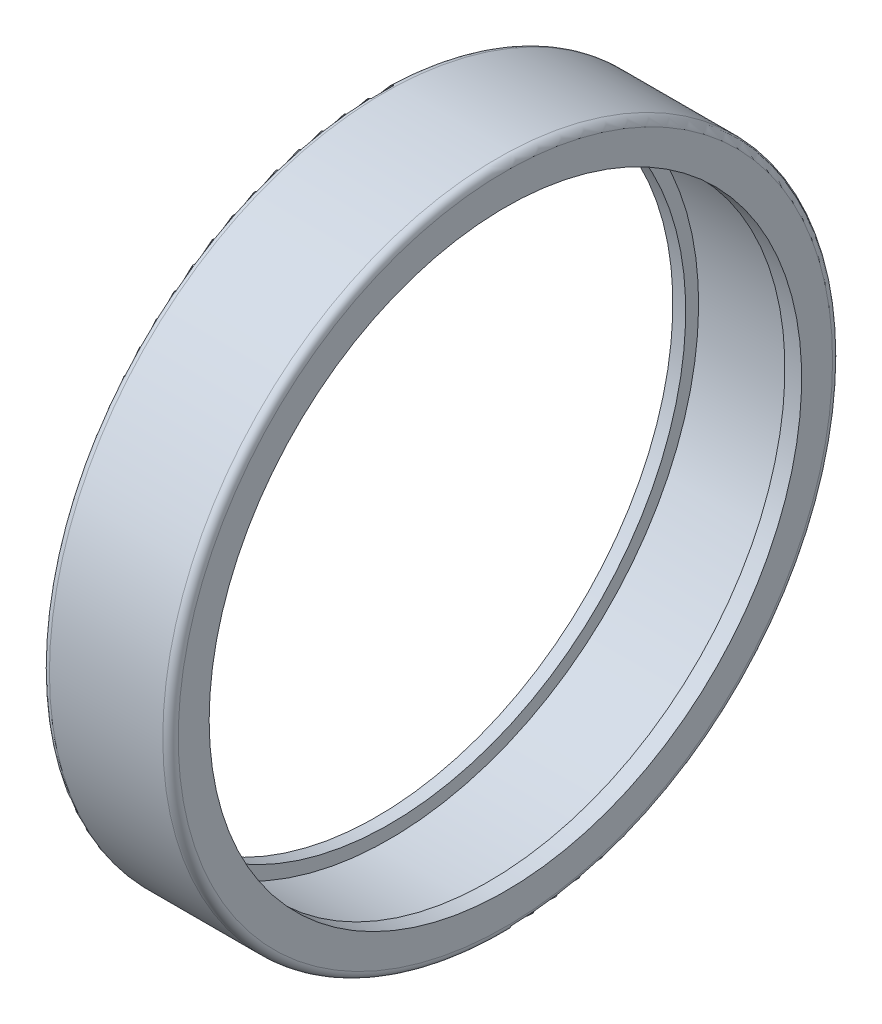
from build123d import *

# Parameters (mm, degrees)
CONG_1_R                = 0.3
ENL_V_MAT_EXTRU_1_DEPTH = 0.5


with BuildPart() as part:
    # Esquisse1 → Base-R_volution (revolve)
    with BuildSketch(Plane.XY, mode=Mode.PRIVATE) as base_r_volution_sk:
        Polygon((0, 13), (5, 13), (5, 11.5), (4.35, 11.5), (4.35, 12), (0.5, 12), (0.5, 11.5), (0, 11.5), align=None)
    revolve(base_r_volution_sk.sketch.rotate(Axis((-1.85, 0, 0), (1, 0, 0)), 90), axis=Axis((-1.85, 0, 0), (1, 0, 0)))

    # Cong_1
    cong_1_edges = [part.edges().sort_by_distance(p)[0] for p in [
        (0, 0, -13),
        (5, 0, -13),
    ]]
    fillet(cong_1_edges, radius=CONG_1_R)

    # Esquisse2 → Enl_v. mat.-Extru.1 (cut)
    with BuildSketch(Plane.ZY):
        with BuildLine():
            Line((-0.79725603, 12.439929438), (-0.899757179, 12.238840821))
            Line((-0.899757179, 12.238840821), (-0.917275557, 12.24890457))
            add(Edge.make_bspline(
                [(-0.917275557, 12.24890457), (-0.917139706, 12.250829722), (-0.916903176, 12.254181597), (-0.916772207, 12.257539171), (-0.91671646, 12.258968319)],
                knots=[0, 0, 0, 0, 1.148701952, 2, 2, 2, 2], degree=3))
            add(Edge.make_bspline(
                [(-0.91671646, 12.258968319), (-0.917194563, 12.262728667), (-0.918232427, 12.270891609), (-0.926282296, 12.282283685), (-0.937780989, 12.294121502), (-0.947748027, 12.301133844), (-0.953244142, 12.305000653)],
                knots=[0, 0, 0, 0, 0.73831218, 1.60272366, 2.678072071, 4, 4, 4, 4], degree=3))
            add(Edge.make_bspline(
                [(-0.953244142, 12.305000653), (-0.962648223, 12.311253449), (-0.98142957, 12.32374121), (-1.011430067, 12.339526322), (-1.042548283, 12.352899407), (-1.074822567, 12.364108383), (-1.108435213, 12.372288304), (-1.143202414, 12.378588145), (-1.179235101, 12.382064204), (-1.203650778, 12.382619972), (-1.216019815, 12.382901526)],
                knots=[0, 0, 0, 0, 0.972885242, 1.942996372, 2.916765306, 3.890416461, 4.883889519, 5.895380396, 6.933794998, 8, 8, 8, 8], degree=3))
            add(Edge.make_bspline(
                [(-1.216019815, 12.382901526), (-1.226281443, 12.382774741), (-1.246236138, 12.382528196), (-1.275168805, 12.379124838), (-1.302402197, 12.374447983), (-1.319498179, 12.369107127), (-1.32783925, 12.366501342)],
                knots=[0, 0, 0, 0, 1.084209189, 2.108346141, 3.077068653, 4, 4, 4, 4], degree=3))
            add(Edge.make_bspline(
                [(-1.32783925, 12.366501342), (-1.333484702, 12.36426344), (-1.344563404, 12.359871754), (-1.359950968, 12.351316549), (-1.373480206, 12.340927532), (-1.385159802, 12.32929449), (-1.394808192, 12.31663672), (-1.401754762, 12.30315541), (-1.406180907, 12.288999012), (-1.406631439, 12.27931388), (-1.406858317, 12.274436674)],
                knots=[0, 0, 0, 0, 1.127971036, 2.213543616, 3.259654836, 4.288353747, 5.269766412, 6.204424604, 7.095790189, 8, 8, 8, 8], degree=3))
            add(Edge.make_bspline(
                [(-1.406858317, 12.274436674), (-1.406668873, 12.27057133), (-1.406297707, 12.262998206), (-1.403701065, 12.252099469), (-1.399180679, 12.242185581), (-1.392585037, 12.233430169), (-1.384306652, 12.225609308), (-1.374302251, 12.218619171), (-1.362424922, 12.212893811), (-1.35378026, 12.209981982), (-1.349271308, 12.208463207)],
                knots=[0, 0, 0, 0, 0.978451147, 1.917017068, 2.81791731, 3.717718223, 4.674561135, 5.691334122, 6.795827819, 8, 8, 8, 8], degree=3))
            add(Edge.make_bspline(
                [(-1.349271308, 12.208463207), (-1.346483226, 12.207687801), (-1.340208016, 12.205942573), (-1.329552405, 12.203790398), (-1.316727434, 12.201648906), (-1.301852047, 12.199107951), (-1.284850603, 12.197028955), (-1.265784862, 12.194571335), (-1.244561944, 12.191874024), (-1.229628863, 12.190408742), (-1.221797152, 12.189640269)],
                knots=[0, 0, 0, 0, 0.538375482, 1.211735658, 2.021344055, 2.958269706, 4.019330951, 5.207982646, 6.535715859, 8, 8, 8, 8], degree=3))
            Line((-1.221797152, 12.189640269), (-1.124700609, 12.17957652))
            add(Edge.make_bspline(
                [(-1.124700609, 12.17957652), (-1.110958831, 12.178000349), (-1.084715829, 12.174990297), (-1.047572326, 12.169132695), (-1.014566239, 12.162198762), (-0.985190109, 12.15460621), (-0.958610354, 12.145586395), (-0.934112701, 12.134771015), (-0.91079657, 12.122924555), (-0.896557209, 12.113199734), (-0.889507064, 12.108384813)],
                knots=[0, 0, 0, 0, 1.335664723, 2.55075067, 3.629676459, 4.591521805, 5.479392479, 6.336449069, 7.176348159, 8, 8, 8, 8], degree=3))
            add(Edge.make_bspline(
                [(-0.889507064, 12.108384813), (-0.882710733, 12.103022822), (-0.86914338, 12.092318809), (-0.851321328, 12.073110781), (-0.83557288, 12.051655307), (-0.822529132, 12.027826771), (-0.811847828, 12.00256088), (-0.804231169, 11.976101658), (-0.799352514, 11.948787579), (-0.798825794, 11.930239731), (-0.79856059, 11.920900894)],
                knots=[0, 0, 0, 0, 0.96044967, 1.917322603, 2.90009847, 3.910212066, 4.927841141, 5.941179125, 6.963384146, 8, 8, 8, 8], degree=3))
            add(Edge.make_bspline(
                [(-0.79856059, 11.920900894), (-0.798732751, 11.913498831), (-0.799073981, 11.89882765), (-0.802004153, 11.877205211), (-0.80643456, 11.856174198), (-0.812768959, 11.83573205), (-0.821218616, 11.816014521), (-0.831386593, 11.796927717), (-0.843075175, 11.778252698), (-0.852361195, 11.766688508), (-0.857079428, 11.760812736)],
                knots=[0, 0, 0, 0, 1.020260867, 2.022197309, 3.003376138, 3.981446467, 4.967883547, 5.956512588, 6.961702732, 8, 8, 8, 8], degree=3))
            add(Edge.make_bspline(
                [(-0.857079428, 11.760812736), (-0.861703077, 11.755562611), (-0.87103879, 11.744961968), (-0.887064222, 11.730578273), (-0.904896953, 11.717322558), (-0.924548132, 11.70502674), (-0.946010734, 11.693638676), (-0.969387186, 11.683416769), (-0.994571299, 11.674312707), (-1.012106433, 11.669152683), (-1.021081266, 11.666511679)],
                knots=[0, 0, 0, 0, 0.873425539, 1.763553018, 2.684020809, 3.646553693, 4.656868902, 5.716763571, 6.831393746, 8, 8, 8, 8], degree=3))
            add(Edge.make_bspline(
                [(-1.021081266, 11.666511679), (-1.035138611, 11.662951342), (-1.063547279, 11.655756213), (-1.107424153, 11.648672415), (-1.152750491, 11.644263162), (-1.183457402, 11.643692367), (-1.199060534, 11.643402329)],
                knots=[0, 0, 0, 0, 0.966421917, 1.95305437, 2.959883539, 4, 4, 4, 4], degree=3))
            add(Edge.make_bspline(
                [(-1.199060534, 11.643402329), (-1.213232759, 11.643665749), (-1.241624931, 11.644193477), (-1.284055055, 11.648080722), (-1.326418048, 11.65409216), (-1.368516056, 11.663292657), (-1.410666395, 11.674266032), (-1.452506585, 11.688301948), (-1.494361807, 11.704330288), (-1.521669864, 11.717096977), (-1.535450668, 11.723539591)],
                knots=[0, 0, 0, 0, 0.975201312, 1.953686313, 2.930123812, 3.917867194, 4.917529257, 5.926074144, 6.953409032, 8, 8, 8, 8], degree=3))
            add(Edge.make_bspline(
                [(-1.535450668, 11.723539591), (-1.54071388, 11.725946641), (-1.550008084, 11.730197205), (-1.562317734, 11.735165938), (-1.571010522, 11.738579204), (-1.575818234, 11.739303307), (-1.577569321, 11.739567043)],
                knots=[0, 0, 0, 0, 1.535740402, 2.711933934, 3.530854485, 4, 4, 4, 4], degree=3))
            add(Edge.make_bspline(
                [(-1.577569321, 11.739567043), (-1.579146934, 11.73940388), (-1.58284407, 11.739021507), (-1.588573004, 11.735909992), (-1.595754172, 11.731959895), (-1.600603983, 11.728218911), (-1.603287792, 11.726148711)],
                knots=[0, 0, 0, 0, 0.642394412, 1.505451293, 2.61955663, 4, 4, 4, 4], degree=3))
            Line((-1.603287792, 11.726148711), (-1.621551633, 11.735280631))
            Line((-1.621551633, 11.735280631), (-1.529859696, 11.945128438))
            Line((-1.529859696, 11.945128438), (-1.51178222, 11.936182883))
            add(Edge.make_bspline(
                [(-1.51178222, 11.936182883), (-1.51178222, 11.934567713), (-1.51178222, 11.931834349), (-1.51178222, 11.929100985), (-1.51178222, 11.927982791)],
                knots=[0, 0, 0, 0, 1.181818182, 2, 2, 2, 2], degree=3))
            add(Edge.make_bspline(
                [(-1.51178222, 11.927982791), (-1.511464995, 11.92333454), (-1.51082452, 11.913949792), (-1.50526971, 11.900429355), (-1.497019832, 11.887221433), (-1.489235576, 11.879742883), (-1.485131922, 11.875800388)],
                knots=[0, 0, 0, 0, 0.921499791, 1.860494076, 2.872108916, 4, 4, 4, 4], degree=3))
            add(Edge.make_bspline(
                [(-1.485131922, 11.875800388), (-1.481576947, 11.872756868), (-1.474261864, 11.866494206), (-1.461991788, 11.858011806), (-1.448577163, 11.849533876), (-1.433647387, 11.841601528), (-1.417325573, 11.833955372), (-1.399682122, 11.826521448), (-1.380648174, 11.819456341), (-1.353783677, 11.810641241), (-1.319754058, 11.801032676), (-1.279120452, 11.792936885), (-1.239584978, 11.787523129), (-1.213551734, 11.786858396), (-1.200737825, 11.786531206)],
                knots=[0, 0, 0, 0, 0.555510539, 1.143075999, 1.769567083, 2.439726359, 3.149382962, 3.909957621, 4.713113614, 5.560117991, 7.267970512, 8.908954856, 10.478546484, 12, 12, 12, 12], degree=3))
            add(Edge.make_bspline(
                [(-1.200737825, 11.786531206), (-1.187484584, 11.786807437), (-1.161861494, 11.787341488), (-1.125034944, 11.792717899), (-1.091015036, 11.800990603), (-1.070190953, 11.809685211), (-1.060031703, 11.813926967)],
                knots=[0, 0, 0, 0, 1.100432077, 2.127514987, 3.086488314, 4, 4, 4, 4], degree=3))
            add(Edge.make_bspline(
                [(-1.060031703, 11.813926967), (-1.054861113, 11.816529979), (-1.044665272, 11.821662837), (-1.031018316, 11.831423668), (-1.018758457, 11.842176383), (-1.008467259, 11.854188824), (-1.000020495, 11.866930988), (-0.994036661, 11.880152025), (-0.989941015, 11.893571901), (-0.98957931, 11.902732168), (-0.989399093, 11.907296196)],
                knots=[0, 0, 0, 0, 1.125677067, 2.219712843, 3.256407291, 4.294230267, 5.290694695, 6.221721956, 7.113987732, 8, 8, 8, 8], degree=3))
            add(Edge.make_bspline(
                [(-0.989399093, 11.907296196), (-0.989553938, 11.91065918), (-0.989855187, 11.917201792), (-0.991852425, 11.926638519), (-0.99556621, 11.935190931), (-1.000399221, 11.94314916), (-1.006883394, 11.950290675), (-1.014744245, 11.956630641), (-1.024055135, 11.962034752), (-1.030802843, 11.965011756), (-1.034313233, 11.966560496)],
                knots=[0, 0, 0, 0, 1.013783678, 1.972294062, 2.886825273, 3.811647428, 4.766310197, 5.778017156, 6.844048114, 8, 8, 8, 8], degree=3))
            add(Edge.make_bspline(
                [(-1.034313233, 11.966560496), (-1.037222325, 11.967587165), (-1.043656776, 11.969857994), (-1.054485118, 11.972800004), (-1.067409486, 11.975453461), (-1.082218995, 11.978519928), (-1.099068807, 11.981291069), (-1.117929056, 11.983768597), (-1.138709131, 11.986688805), (-1.153271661, 11.98828137), (-1.16085556, 11.989110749)],
                knots=[0, 0, 0, 0, 0.5747891, 1.27134239, 2.088820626, 3.033330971, 4.089642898, 5.270110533, 6.578323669, 8, 8, 8, 8], degree=3))
            Line((-1.16085556, 11.989110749), (-1.255529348, 11.998801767))
            add(Edge.make_bspline(
                [(-1.255529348, 11.998801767), (-1.26317452, 11.999572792), (-1.27791915, 12.001059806), (-1.299136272, 12.003795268), (-1.318660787, 12.006132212), (-1.336373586, 12.008520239), (-1.352309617, 12.011071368), (-1.366593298, 12.013100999), (-1.379040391, 12.015639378), (-1.400182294, 12.019927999), (-1.430572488, 12.029438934), (-1.455945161, 12.041475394), (-1.468918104, 12.047629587)],
                knots=[0, 0, 0, 0, 1.046031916, 2.017397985, 2.912186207, 3.723109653, 4.450332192, 5.109398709, 5.686600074, 6.179228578, 8.046455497, 10, 10, 10, 10], degree=3))
            add(Edge.make_bspline(
                [(-1.468918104, 12.047629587), (-1.477925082, 12.052696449), (-1.495830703, 12.062769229), (-1.519422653, 12.082810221), (-1.54033788, 12.106040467), (-1.551309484, 12.123908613), (-1.556882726, 12.132985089)],
                knots=[0, 0, 0, 0, 0.995701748, 1.979427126, 2.973610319, 4, 4, 4, 4], degree=3))
            add(Edge.make_bspline(
                [(-1.556882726, 12.132985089), (-1.561381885, 12.141753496), (-1.570437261, 12.159401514), (-1.579121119, 12.188341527), (-1.584740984, 12.21892753), (-1.58542143, 12.239994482), (-1.585769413, 12.250768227)],
                knots=[0, 0, 0, 0, 0.963245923, 1.938708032, 2.945845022, 4, 4, 4, 4], degree=3))
            add(Edge.make_bspline(
                [(-1.585769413, 12.250768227), (-1.585582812, 12.25972688), (-1.585217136, 12.277282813), (-1.581510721, 12.302983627), (-1.5757989, 12.327462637), (-1.567762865, 12.350800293), (-1.557226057, 12.372868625), (-1.544484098, 12.393882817), (-1.529410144, 12.413744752), (-1.517693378, 12.425698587), (-1.51178222, 12.431729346)],
                knots=[0, 0, 0, 0, 1.068408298, 2.093719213, 3.091651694, 4.064572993, 5.032823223, 6.004133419, 6.993076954, 8, 8, 8, 8], degree=3))
            add(Edge.make_bspline(
                [(-1.51178222, 12.431729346), (-1.503407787, 12.43937334), (-1.486505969, 12.454800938), (-1.457144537, 12.473570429), (-1.425237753, 12.489970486), (-1.390259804, 12.503375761), (-1.352143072, 12.51357336), (-1.311090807, 12.520641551), (-1.267064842, 12.52526786), (-1.236718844, 12.525770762), (-1.221051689, 12.526030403)],
                knots=[0, 0, 0, 0, 0.867095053, 1.750026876, 2.658740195, 3.61224737, 4.613037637, 5.676217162, 6.800268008, 8, 8, 8, 8], degree=3))
            add(Edge.make_bspline(
                [(-1.221051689, 12.526030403), (-1.207563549, 12.525893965), (-1.180983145, 12.525625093), (-1.141870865, 12.522232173), (-1.104114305, 12.517428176), (-1.073506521, 12.511136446), (-1.04890265, 12.505123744), (-1.029434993, 12.499763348), (-1.008920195, 12.493316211), (-0.987255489, 12.486299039), (-0.964568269, 12.47819444), (-0.94071554, 12.469526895), (-0.91583752, 12.459737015), (-0.898940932, 12.452809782), (-0.890252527, 12.449247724)],
                knots=[0, 0, 0, 0, 1.418580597, 2.795525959, 4.127438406, 5.420692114, 6.080098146, 6.792018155, 7.544481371, 8.342241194, 9.187648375, 10.078804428, 11.012100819, 12, 12, 12, 12], degree=3))
            add(Edge.make_bspline(
                [(-0.890252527, 12.449247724), (-0.884735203, 12.447101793), (-0.874987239, 12.44331038), (-0.862034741, 12.438743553), (-0.852647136, 12.435908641), (-0.847457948, 12.435171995), (-0.845524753, 12.434897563)],
                knots=[0, 0, 0, 0, 1.508590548, 2.66536534, 3.502791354, 4, 4, 4, 4], degree=3))
            add(Edge.make_bspline(
                [(-0.845524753, 12.434897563), (-0.843204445, 12.435106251), (-0.838309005, 12.435546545), (-0.830826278, 12.438474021), (-0.822794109, 12.44297289), (-0.817577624, 12.447054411), (-0.814774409, 12.449247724)],
                knots=[0, 0, 0, 0, 0.806318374, 1.701189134, 2.764673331, 4, 4, 4, 4], degree=3))
            Line((-0.814774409, 12.449247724), (-0.79725603, 12.439929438))
        make_face()
        with BuildLine():
            Line((0.019025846, 12.053966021), (-0.106771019, 11.952955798))
            Line((-0.106771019, 11.952955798), (-0.106771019, 11.724657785))
            add(Edge.make_bspline(
                [(-0.106771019, 11.724657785), (-0.106669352, 11.721605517), (-0.10647914, 11.715894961), (-0.104938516, 11.707870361), (-0.102613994, 11.700862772), (-0.098973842, 11.694813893), (-0.093859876, 11.68989999), (-0.087624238, 11.685510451), (-0.079778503, 11.68206361), (-0.074050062, 11.680187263), (-0.0709888, 11.679184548)],
                knots=[0, 0, 0, 0, 1.150123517, 2.151792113, 3.070577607, 3.922405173, 4.783843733, 5.726221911, 6.784899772, 8, 8, 8, 8], degree=3))
            Line((-0.0709888, 11.679184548), (-0.0709888, 11.655329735))
            Line((-0.0709888, 11.655329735), (-0.333391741, 11.655329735))
            Line((-0.333391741, 11.655329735), (-0.333391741, 11.679184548))
            add(Edge.make_bspline(
                [(-0.333391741, 11.679184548), (-0.330266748, 11.680247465), (-0.324406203, 11.682240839), (-0.316460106, 11.685857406), (-0.310226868, 11.690219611), (-0.305190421, 11.694992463), (-0.301812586, 11.700995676), (-0.299133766, 11.707801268), (-0.297994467, 11.715927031), (-0.297743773, 11.72161289), (-0.297609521, 11.724657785)],
                knots=[0, 0, 0, 0, 1.245049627, 2.334940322, 3.277358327, 4.105699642, 4.925380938, 5.852235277, 6.849827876, 8, 8, 8, 8], degree=3))
            Line((-0.297609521, 11.724657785), (-0.297609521, 12.445334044))
            add(Edge.make_bspline(
                [(-0.297609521, 12.445334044), (-0.297742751, 12.448317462), (-0.297991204, 12.453881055), (-0.29913977, 12.461817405), (-0.301790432, 12.468464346), (-0.30530913, 12.474281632), (-0.310146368, 12.479228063), (-0.316474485, 12.483562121), (-0.324401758, 12.487195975), (-0.330265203, 12.489186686), (-0.333391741, 12.490248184)],
                knots=[0, 0, 0, 0, 1.136968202, 2.120262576, 3.033418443, 3.84032541, 4.69303108, 5.643963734, 6.743701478, 8, 8, 8, 8], degree=3))
            Line((-0.333391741, 12.490248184), (-0.333391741, 12.514102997))
            Line((-0.333391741, 12.514102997), (-0.0709888, 12.514102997))
            Line((-0.0709888, 12.514102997), (-0.0709888, 12.490248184))
            add(Edge.make_bspline(
                [(-0.0709888, 12.490248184), (-0.074118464, 12.489257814), (-0.079926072, 12.487420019), (-0.087820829, 12.483849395), (-0.094208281, 12.479654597), (-0.099119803, 12.47462345), (-0.102544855, 12.468766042), (-0.10498833, 12.462081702), (-0.106457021, 12.454341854), (-0.106662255, 12.448819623), (-0.106771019, 12.445893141)],
                knots=[0, 0, 0, 0, 1.256251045, 2.331180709, 3.307635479, 4.165642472, 4.997871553, 5.88601592, 6.879703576, 8, 8, 8, 8], degree=3))
            Line((-0.106771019, 12.445893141), (-0.106771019, 12.151621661))
            Line((-0.106771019, 12.151621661), (0.245460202, 12.433593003))
            add(Edge.make_bspline(
                [(0.245460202, 12.433593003), (0.24914996, 12.436679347), (0.255748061, 12.442198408), (0.26348402, 12.450656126), (0.268845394, 12.458025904), (0.269697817, 12.463111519), (0.270060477, 12.465275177)],
                knots=[0, 0, 0, 0, 1.402912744, 2.508716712, 3.365538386, 4, 4, 4, 4], degree=3))
            add(Edge.make_bspline(
                [(0.270060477, 12.465275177), (0.269611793, 12.468221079), (0.268658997, 12.474476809), (0.260276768, 12.481598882), (0.248540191, 12.487088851), (0.238958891, 12.489105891), (0.233532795, 12.490248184)],
                knots=[0, 0, 0, 0, 0.728704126, 1.547429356, 2.61105656, 4, 4, 4, 4], degree=3))
            Line((0.233532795, 12.490248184), (0.233532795, 12.514102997))
            Line((0.233532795, 12.514102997), (0.585018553, 12.514102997))
            Line((0.585018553, 12.514102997), (0.585018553, 12.490248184))
            add(Edge.make_bspline(
                [(0.585018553, 12.490248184), (0.581591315, 12.489547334), (0.575253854, 12.488251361), (0.566600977, 12.485815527), (0.559459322, 12.483276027), (0.554274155, 12.480705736), (0.550154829, 12.478121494), (0.546164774, 12.475189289), (0.541035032, 12.471383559), (0.534861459, 12.466407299), (0.527410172, 12.460705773), (0.518869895, 12.454033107), (0.509279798, 12.446280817), (0.502519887, 12.440800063), (0.498917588, 12.437879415)],
                knots=[0, 0, 0, 0, 1.230627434, 2.275608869, 3.160902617, 3.894135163, 4.306603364, 4.870763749, 5.635890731, 6.554303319, 7.660596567, 8.937535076, 10.368038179, 12, 12, 12, 12], degree=3))
            Line((0.498917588, 12.437879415), (0.450462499, 12.39799715))
            Line((0.450462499, 12.39799715), (0.15880014, 12.165599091))
            Line((0.15880014, 12.165599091), (0.491090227, 11.770876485))
            add(Edge.make_bspline(
                [(0.491090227, 11.770876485), (0.494814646, 11.766339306), (0.50192528, 11.757676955), (0.512155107, 11.745305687), (0.52172678, 11.734303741), (0.530349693, 11.724481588), (0.538283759, 11.7160072), (0.545362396, 11.708732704), (0.55156139, 11.702619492), (0.558913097, 11.696197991), (0.568397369, 11.689917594), (0.580647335, 11.683598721), (0.594314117, 11.679021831), (0.603941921, 11.677034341), (0.608873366, 11.676016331)],
                knots=[0, 0, 0, 0, 1.360803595, 2.598037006, 3.721133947, 4.74127298, 5.627727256, 6.411890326, 7.094232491, 7.645625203, 8.672148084, 9.721943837, 10.83315975, 12, 12, 12, 12], degree=3))
            Line((0.608873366, 11.676016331), (0.608873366, 11.655329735))
            Line((0.608873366, 11.655329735), (0.272296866, 11.655329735))
            Line((0.272296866, 11.655329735), (0.272296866, 11.679184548))
            add(Edge.make_bspline(
                [(0.272296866, 11.679184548), (0.277273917, 11.680368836), (0.286050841, 11.682457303), (0.29692303, 11.687526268), (0.304555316, 11.694287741), (0.305430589, 11.70011114), (0.305842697, 11.702852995)],
                knots=[0, 0, 0, 0, 1.385073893, 2.44254822, 3.266698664, 4, 4, 4, 4], degree=3))
            add(Edge.make_bspline(
                [(0.305842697, 11.702852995), (0.30530398, 11.704937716), (0.303805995, 11.710734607), (0.297283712, 11.720277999), (0.287800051, 11.733587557), (0.279938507, 11.743456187), (0.275465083, 11.749071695)],
                knots=[0, 0, 0, 0, 0.461725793, 1.283900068, 2.454468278, 4, 4, 4, 4], degree=3))
            Line((0.275465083, 11.749071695), (0.019025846, 12.053966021))
        make_face()
        with BuildLine():
            Line((1.252953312, 12.025079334), (1.252953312, 11.723912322))
            add(Edge.make_bspline(
                [(1.252953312, 11.723912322), (1.253060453, 11.720923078), (1.253262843, 11.715276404), (1.254755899, 11.707363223), (1.257114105, 11.700483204), (1.260753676, 11.694607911), (1.26592942, 11.689907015), (1.272090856, 11.685500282), (1.279948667, 11.682066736), (1.285675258, 11.680188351), (1.288735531, 11.679184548)],
                knots=[0, 0, 0, 0, 1.138371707, 2.150380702, 3.056353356, 3.89688452, 4.750642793, 5.702749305, 6.772356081, 8, 8, 8, 8], degree=3))
            Line((1.288735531, 11.679184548), (1.288735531, 11.655329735))
            Line((1.288735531, 11.655329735), (1.02633259, 11.655329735))
            Line((1.02633259, 11.655329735), (1.02633259, 11.679184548))
            add(Edge.make_bspline(
                [(1.02633259, 11.679184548), (1.029457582, 11.680247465), (1.035318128, 11.682240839), (1.043264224, 11.685857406), (1.049497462, 11.690219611), (1.054533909, 11.694992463), (1.057911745, 11.700995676), (1.060590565, 11.707801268), (1.061729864, 11.715927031), (1.061980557, 11.72161289), (1.062114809, 11.724657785)],
                knots=[0, 0, 0, 0, 1.245049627, 2.334940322, 3.277358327, 4.105699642, 4.925380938, 5.852235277, 6.849827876, 8, 8, 8, 8], degree=3))
            Line((1.062114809, 11.724657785), (1.062114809, 12.444774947))
            add(Edge.make_bspline(
                [(1.062114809, 12.444774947), (1.061977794, 12.447819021), (1.061721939, 12.453503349), (1.060624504, 12.461581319), (1.057876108, 12.468305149), (1.054481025, 12.474260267), (1.049569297, 12.47922292), (1.043252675, 12.4835638), (1.035321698, 12.487195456), (1.029458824, 12.489186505), (1.02633259, 12.490248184)],
                knots=[0, 0, 0, 0, 1.150912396, 2.149147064, 3.054708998, 3.874917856, 4.720532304, 5.663556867, 6.754149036, 8, 8, 8, 8], degree=3))
            Line((1.02633259, 12.490248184), (1.02633259, 12.514102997))
            Line((1.02633259, 12.514102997), (1.78055468, 12.514102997))
            add(Edge.make_bspline(
                [(1.78055468, 12.514102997), (1.783475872, 12.514241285), (1.789038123, 12.514504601), (1.796893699, 12.515618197), (1.803611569, 12.518157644), (1.809470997, 12.521564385), (1.814506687, 12.526478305), (1.818722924, 12.532946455), (1.822428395, 12.5408875), (1.82441142, 12.546755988), (1.825468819, 12.549885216)],
                knots=[0, 0, 0, 0, 1.112138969, 2.117627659, 2.99930499, 3.825474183, 4.677233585, 5.646578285, 6.745095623, 8, 8, 8, 8], degree=3))
            Line((1.825468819, 12.549885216), (1.849323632, 12.549885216))
            Line((1.849323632, 12.549885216), (1.849323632, 12.3351919))
            Line((1.849323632, 12.3351919), (1.825468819, 12.3351919))
            add(Edge.make_bspline(
                [(1.825468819, 12.3351919), (1.824414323, 12.338382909), (1.822452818, 12.344318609), (1.818781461, 12.352296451), (1.81444528, 12.358618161), (1.809477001, 12.363516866), (1.80360987, 12.366918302), (1.796894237, 12.369459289), (1.789037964, 12.370572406), (1.783475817, 12.370835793), (1.78055468, 12.37097412)],
                knots=[0, 0, 0, 0, 1.276704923, 2.374841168, 3.324389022, 4.175852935, 5.001735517, 5.88310698, 6.88824685, 8, 8, 8, 8], degree=3))
            Line((1.78055468, 12.37097412), (1.252953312, 12.37097412))
            Line((1.252953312, 12.37097412), (1.252953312, 12.168208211))
            Line((1.252953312, 12.168208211), (1.600711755, 12.168208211))
            add(Edge.make_bspline(
                [(1.600711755, 12.168208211), (1.603763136, 12.168316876), (1.609533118, 12.168522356), (1.617569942, 12.16998971), (1.62453542, 12.172349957), (1.630312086, 12.176080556), (1.635434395, 12.180930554), (1.639540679, 12.187439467), (1.643579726, 12.195111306), (1.645524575, 12.20091002), (1.646557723, 12.20399043)],
                knots=[0, 0, 0, 0, 1.148343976, 2.171450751, 3.066779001, 3.897434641, 4.741161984, 5.701365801, 6.77891266, 8, 8, 8, 8], degree=3))
            Line((1.646557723, 12.20399043), (1.670412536, 12.20399043))
            Line((1.670412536, 12.20399043), (1.670412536, 11.989297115))
            Line((1.670412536, 11.989297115), (1.646557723, 11.989297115))
            add(Edge.make_bspline(
                [(1.646557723, 11.989297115), (1.645509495, 11.992369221), (1.643518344, 11.998204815), (1.639654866, 12.005979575), (1.635367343, 12.012373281), (1.630319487, 12.017211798), (1.624533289, 12.020936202), (1.617570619, 12.023298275), (1.609532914, 12.024765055), (1.603763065, 12.024970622), (1.600711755, 12.025079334)],
                knots=[0, 0, 0, 0, 1.220845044, 2.31904542, 3.25977879, 4.103338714, 4.933829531, 5.828980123, 6.851883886, 8, 8, 8, 8], degree=3))
            Line((1.600711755, 12.025079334), (1.252953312, 12.025079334))
        make_face()
    extrude(amount=-ENL_V_MAT_EXTRU_1_DEPTH, mode=Mode.SUBTRACT)


solid = part.part
